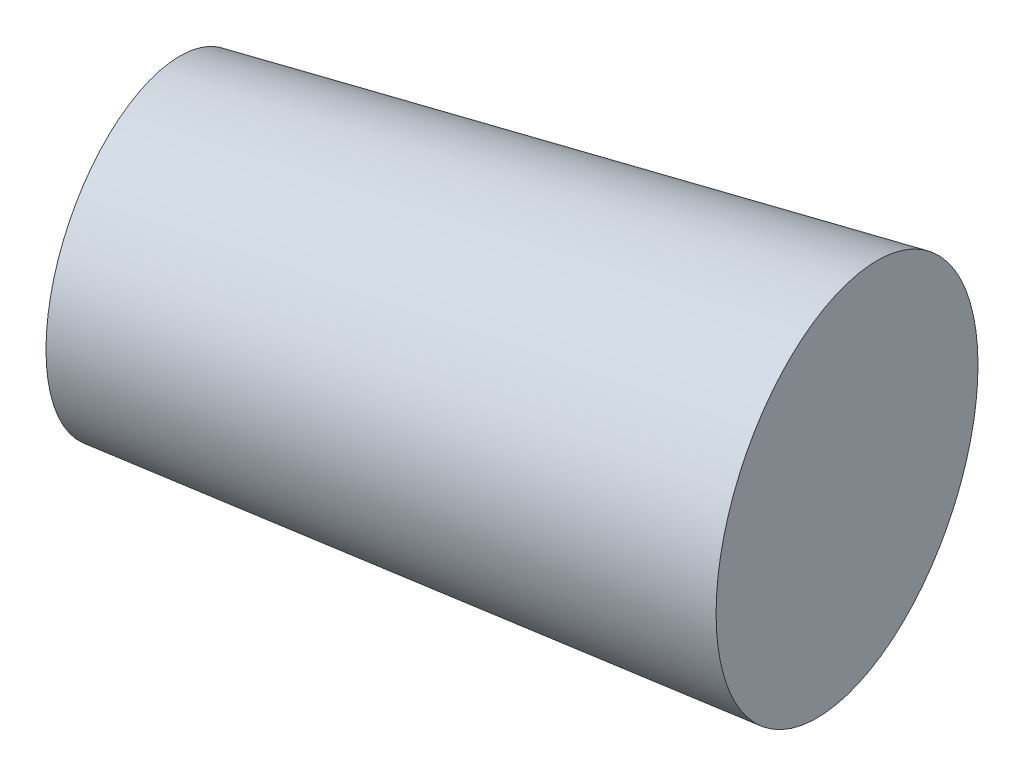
ISO-10303-21;
HEADER;
FILE_DESCRIPTION(('STEP AP214'),'2;1');
FILE_NAME('part.step','',(''),(''),'','','');
FILE_SCHEMA(('AUTOMOTIVE_DESIGN { 1 0 10303 214 1 1 1 1 }'));
ENDSEC;
DATA;
#1=APPLICATION_CONTEXT('core data for automotive mechanical design processes');
#2=APPLICATION_PROTOCOL_DEFINITION('international standard','automotive_design',2000,#1);
#3=PRODUCT_CONTEXT('',#1,'mechanical');
#4=PRODUCT('Part','Part','',(#3));
#5=PRODUCT_RELATED_PRODUCT_CATEGORY('part','',(#4));
#6=PRODUCT_DEFINITION_FORMATION('','',#4);
#7=PRODUCT_DEFINITION_CONTEXT('part definition',#1,'design');
#8=PRODUCT_DEFINITION('design','',#6,#7);
#9=PRODUCT_DEFINITION_SHAPE('','',#8);
#10=(LENGTH_UNIT() NAMED_UNIT(*) SI_UNIT(.MILLI.,.METRE.));
#11=(NAMED_UNIT(*) PLANE_ANGLE_UNIT() SI_UNIT($,.RADIAN.));
#12=(NAMED_UNIT(*) SI_UNIT($,.STERADIAN.) SOLID_ANGLE_UNIT());
#13=UNCERTAINTY_MEASURE_WITH_UNIT(LENGTH_MEASURE(1.E-05),#10,'distance_accuracy_value','');
#14=(GEOMETRIC_REPRESENTATION_CONTEXT(3) GLOBAL_UNCERTAINTY_ASSIGNED_CONTEXT((#13)) GLOBAL_UNIT_ASSIGNED_CONTEXT((#10,
#11,#12)) REPRESENTATION_CONTEXT('',''));
#15=CARTESIAN_POINT('',(0.,0.,0.));
#16=DIRECTION('',(0.,0.,1.));
#17=DIRECTION('',(1.,0.,0.));
#18=AXIS2_PLACEMENT_3D('',#15,#16,#17);
#19=CARTESIAN_POINT('',(6.52145522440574,0.,-1.58783257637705));
#20=DIRECTION('',(0.971615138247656,0.,-0.236567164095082));
#21=DIRECTION('',(-0.236567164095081,0.,-0.971615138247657));
#22=AXIS2_PLACEMENT_3D('',#19,#20,#21);
#23=CONICAL_SURFACE('',#22,6.25,0.0523598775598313);
#24=CARTESIAN_POINT('',(-13.0045656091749,0.,3.16632901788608));
#25=DIRECTION('',(-0.971615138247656,0.,0.236567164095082));
#26=DIRECTION('',(0.236567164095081,0.,0.971615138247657));
#27=AXIS2_PLACEMENT_3D('',#24,#25,#26);
#28=CIRCLE('',#27,5.19678937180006);
#29=CARTESIAN_POINT('',(-11.7751758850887,0.,8.21560824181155));
#30=VERTEX_POINT('',#29);
#31=EDGE_CURVE('E10',#30,#30,#28,.T.);
#32=ORIENTED_EDGE('',*,*,#31,.F.);
#33=EDGE_LOOP('',(#32));
#34=FACE_BOUND('',#33,.T.);
#35=CARTESIAN_POINT('',(6.52145522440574,0.,-1.58783257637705));
#36=DIRECTION('',(-0.971615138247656,0.,0.236567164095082));
#37=DIRECTION('',(0.236567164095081,0.,0.971615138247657));
#38=AXIS2_PLACEMENT_3D('',#35,#36,#37);
#39=CIRCLE('',#38,6.25);
#40=CARTESIAN_POINT('',(8.,0.,4.48476203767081));
#41=VERTEX_POINT('',#40);
#42=EDGE_CURVE('E37',#41,#41,#39,.T.);
#43=ORIENTED_EDGE('',*,*,#42,.T.);
#44=EDGE_LOOP('',(#43));
#45=FACE_BOUND('',#44,.T.);
#46=ADVANCED_FACE('F31',(#34,#45),#23,.T.);
#47=CARTESIAN_POINT('',(-13.0045656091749,0.,3.16632901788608));
#48=DIRECTION('',(0.971615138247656,0.,-0.236567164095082));
#49=DIRECTION('',(-0.236567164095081,0.,-0.971615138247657));
#50=AXIS2_PLACEMENT_3D('',#47,#48,#49);
#51=PLANE('',#50);
#52=ORIENTED_EDGE('',*,*,#31,.T.);
#53=EDGE_LOOP('',(#52));
#54=FACE_BOUND('',#53,.T.);
#55=ADVANCED_FACE('F46',(#54),#51,.F.);
#56=CARTESIAN_POINT('',(6.52145522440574,0.,-1.58783257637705));
#57=DIRECTION('',(-0.971615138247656,0.,0.236567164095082));
#58=DIRECTION('',(0.236567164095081,0.,0.971615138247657));
#59=AXIS2_PLACEMENT_3D('',#56,#57,#58);
#60=PLANE('',#59);
#61=ORIENTED_EDGE('',*,*,#42,.F.);
#62=EDGE_LOOP('',(#61));
#63=FACE_BOUND('',#62,.T.);
#64=ADVANCED_FACE('F44',(#63),#60,.F.);
#65=CLOSED_SHELL('',(#46,#55,#64));
#66=MANIFOLD_SOLID_BREP('B2',#65);
#67=ADVANCED_BREP_SHAPE_REPRESENTATION('',(#18,#66),#14);
#68=SHAPE_DEFINITION_REPRESENTATION(#9,#67);
ENDSEC;
END-ISO-10303-21;
